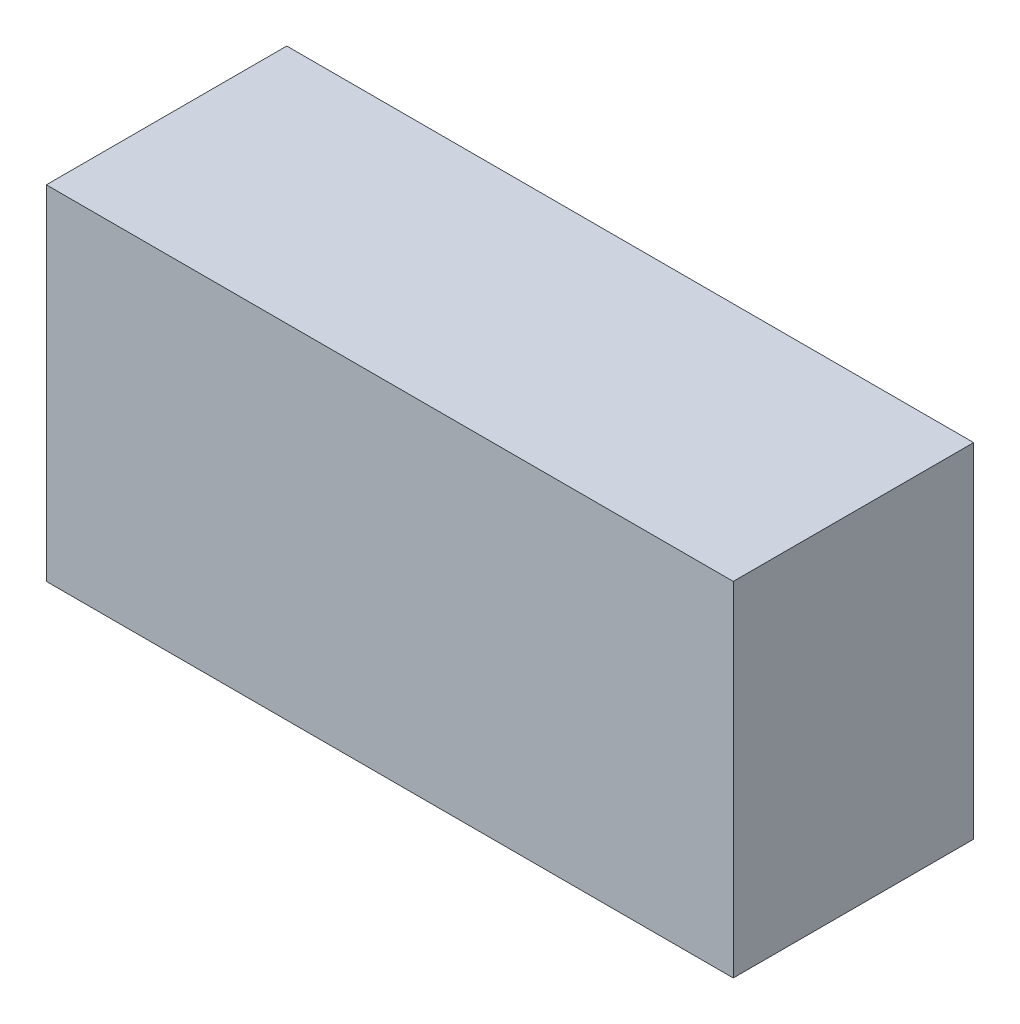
from build123d import *

# Parameters (mm, degrees)
ESQUISSE1_W      = 100
ESQUISSE1_H      = 50
EXTRUSION1_DEPTH = 35


with BuildPart() as part:
    # Esquisse1 → Extrusion1 (new body)
    with BuildSketch(Plane.XY):
        with Locations((50, 25)):
            Rectangle(ESQUISSE1_W, ESQUISSE1_H)
    extrude(amount=EXTRUSION1_DEPTH)


solid = part.part
